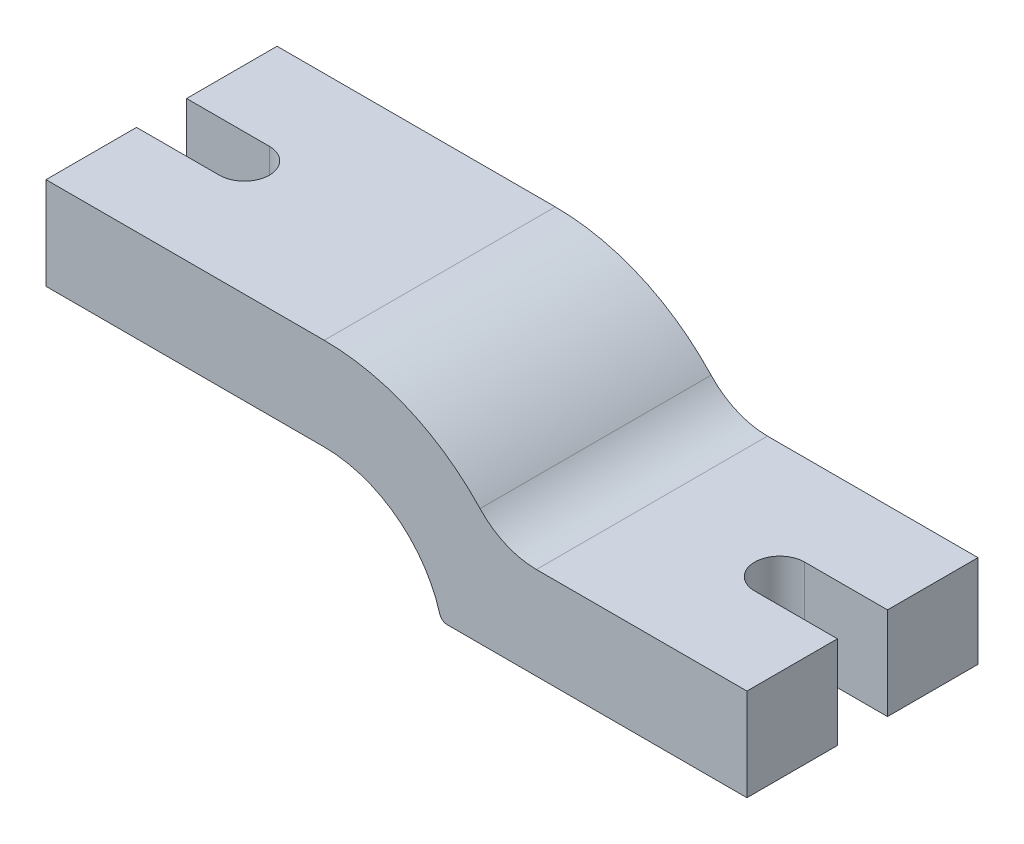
ISO-10303-21;
HEADER;
FILE_DESCRIPTION(('STEP AP214'),'2;1');
FILE_NAME('part.step','',(''),(''),'','','');
FILE_SCHEMA(('AUTOMOTIVE_DESIGN { 1 0 10303 214 1 1 1 1 }'));
ENDSEC;
DATA;
#1=APPLICATION_CONTEXT('core data for automotive mechanical design processes');
#2=APPLICATION_PROTOCOL_DEFINITION('international standard','automotive_design',2000,#1);
#3=PRODUCT_CONTEXT('',#1,'mechanical');
#4=PRODUCT('Part','Part','',(#3));
#5=PRODUCT_RELATED_PRODUCT_CATEGORY('part','',(#4));
#6=PRODUCT_DEFINITION_FORMATION('','',#4);
#7=PRODUCT_DEFINITION_CONTEXT('part definition',#1,'design');
#8=PRODUCT_DEFINITION('design','',#6,#7);
#9=PRODUCT_DEFINITION_SHAPE('','',#8);
#10=(LENGTH_UNIT() NAMED_UNIT(*) SI_UNIT(.MILLI.,.METRE.));
#11=(NAMED_UNIT(*) PLANE_ANGLE_UNIT() SI_UNIT($,.RADIAN.));
#12=(NAMED_UNIT(*) SI_UNIT($,.STERADIAN.) SOLID_ANGLE_UNIT());
#13=UNCERTAINTY_MEASURE_WITH_UNIT(LENGTH_MEASURE(1.E-05),#10,'distance_accuracy_value','');
#14=(GEOMETRIC_REPRESENTATION_CONTEXT(3) GLOBAL_UNCERTAINTY_ASSIGNED_CONTEXT((#13)) GLOBAL_UNIT_ASSIGNED_CONTEXT((#10,
#11,#12)) REPRESENTATION_CONTEXT('',''));
#15=CARTESIAN_POINT('',(0.,0.,0.));
#16=DIRECTION('',(0.,0.,1.));
#17=DIRECTION('',(1.,0.,0.));
#18=AXIS2_PLACEMENT_3D('',#15,#16,#17);
#19=CARTESIAN_POINT('',(54.8786841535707,15.625,30.));
#20=DIRECTION('',(-1.,0.,0.));
#21=DIRECTION('',(0.,0.,1.));
#22=AXIS2_PLACEMENT_3D('',#19,#20,#21);
#23=PLANE('',#22);
#24=DIRECTION('',(0.,0.,-1.));
#25=VECTOR('',#24,1.);
#26=CARTESIAN_POINT('',(54.8786841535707,3.625,30.));
#27=LINE('',#26,#25);
#28=CARTESIAN_POINT('',(54.8786841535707,3.625,30.));
#29=VERTEX_POINT('',#28);
#30=CARTESIAN_POINT('',(54.8786841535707,3.62499999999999,18.25));
#31=VERTEX_POINT('',#30);
#32=EDGE_CURVE('E187',#29,#31,#27,.T.);
#33=ORIENTED_EDGE('',*,*,#32,.T.);
#34=DIRECTION('',(0.,1.,0.));
#35=VECTOR('',#34,1.);
#36=CARTESIAN_POINT('',(54.8786841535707,3.62499999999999,18.25));
#37=LINE('',#36,#35);
#38=CARTESIAN_POINT('',(54.8786841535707,15.625,18.25));
#39=VERTEX_POINT('',#38);
#40=EDGE_CURVE('E234',#31,#39,#37,.T.);
#41=ORIENTED_EDGE('',*,*,#40,.T.);
#42=DIRECTION('',(0.,0.,-1.));
#43=VECTOR('',#42,1.);
#44=CARTESIAN_POINT('',(54.8786841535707,15.625,30.));
#45=LINE('',#44,#43);
#46=CARTESIAN_POINT('',(54.8786841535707,15.625,30.));
#47=VERTEX_POINT('',#46);
#48=EDGE_CURVE('E188',#47,#39,#45,.T.);
#49=ORIENTED_EDGE('',*,*,#48,.F.);
#50=DIRECTION('',(0.,1.,0.));
#51=VECTOR('',#50,1.);
#52=CARTESIAN_POINT('',(54.8786841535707,15.625,30.));
#53=LINE('',#52,#51);
#54=EDGE_CURVE('E262',#29,#47,#53,.T.);
#55=ORIENTED_EDGE('',*,*,#54,.F.);
#56=EDGE_LOOP('',(#33,#41,#49,#55));
#57=FACE_BOUND('',#56,.T.);
#58=ADVANCED_FACE('F39',(#57),#23,.F.);
#59=CARTESIAN_POINT('',(-36.12,15.625,30.));
#60=DIRECTION('',(1.,0.,0.));
#61=DIRECTION('',(0.,0.,-1.));
#62=AXIS2_PLACEMENT_3D('',#59,#60,#61);
#63=PLANE('',#62);
#64=DIRECTION('',(0.,0.,-1.));
#65=VECTOR('',#64,1.);
#66=CARTESIAN_POINT('',(-36.12,15.625,30.));
#67=LINE('',#66,#65);
#68=CARTESIAN_POINT('',(-36.12,15.625,11.75));
#69=VERTEX_POINT('',#68);
#70=CARTESIAN_POINT('',(-36.12,15.625,0.));
#71=VERTEX_POINT('',#70);
#72=EDGE_CURVE('E295',#69,#71,#67,.T.);
#73=ORIENTED_EDGE('',*,*,#72,.F.);
#74=DIRECTION('',(0.,1.,0.));
#75=VECTOR('',#74,1.);
#76=CARTESIAN_POINT('',(-36.12,3.62499999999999,11.75));
#77=LINE('',#76,#75);
#78=CARTESIAN_POINT('',(-36.12,27.625,11.75));
#79=VERTEX_POINT('',#78);
#80=EDGE_CURVE('E248',#69,#79,#77,.T.);
#81=ORIENTED_EDGE('',*,*,#80,.T.);
#82=DIRECTION('',(0.,0.,-1.));
#83=VECTOR('',#82,1.);
#84=CARTESIAN_POINT('',(-36.12,27.625,30.));
#85=LINE('',#84,#83);
#86=CARTESIAN_POINT('',(-36.12,27.625,0.));
#87=VERTEX_POINT('',#86);
#88=EDGE_CURVE('E299',#79,#87,#85,.T.);
#89=ORIENTED_EDGE('',*,*,#88,.T.);
#90=DIRECTION('',(0.,-1.,0.));
#91=VECTOR('',#90,1.);
#92=CARTESIAN_POINT('',(-36.12,15.625,0.));
#93=LINE('',#92,#91);
#94=EDGE_CURVE('E289',#87,#71,#93,.T.);
#95=ORIENTED_EDGE('',*,*,#94,.T.);
#96=EDGE_LOOP('',(#73,#81,#89,#95));
#97=FACE_BOUND('',#96,.T.);
#98=ADVANCED_FACE('F346',(#97),#63,.F.);
#99=CARTESIAN_POINT('',(0.,0.,30.));
#100=DIRECTION('',(0.,0.,-1.));
#101=DIRECTION('',(-1.,0.,0.));
#102=AXIS2_PLACEMENT_3D('',#99,#100,#101);
#103=CYLINDRICAL_SURFACE('',#102,15.625);
#104=CARTESIAN_POINT('',(0.,0.,0.));
#105=DIRECTION('',(0.,0.,-1.));
#106=DIRECTION('',(1.,0.,0.));
#107=AXIS2_PLACEMENT_3D('',#104,#105,#106);
#108=CIRCLE('',#107,15.625);
#109=CARTESIAN_POINT('',(0.,15.625,0.));
#110=VERTEX_POINT('',#109);
#111=CARTESIAN_POINT('',(15.0081949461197,4.34680451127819,0.));
#112=VERTEX_POINT('',#111);
#113=EDGE_CURVE('E251',#110,#112,#108,.T.);
#114=ORIENTED_EDGE('',*,*,#113,.T.);
#115=DIRECTION('',(0.,0.,-1.));
#116=VECTOR('',#115,1.);
#117=CARTESIAN_POINT('',(15.0081949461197,4.34680451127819,30.));
#118=LINE('',#117,#116);
#119=CARTESIAN_POINT('',(15.0081949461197,4.34680451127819,30.));
#120=VERTEX_POINT('',#119);
#121=EDGE_CURVE('E208',#112,#120,#118,.F.);
#122=ORIENTED_EDGE('',*,*,#121,.T.);
#123=CARTESIAN_POINT('',(0.,0.,30.));
#124=DIRECTION('',(0.,0.,-1.));
#125=DIRECTION('',(1.,0.,0.));
#126=AXIS2_PLACEMENT_3D('',#123,#124,#125);
#127=CIRCLE('',#126,15.625);
#128=CARTESIAN_POINT('',(0.,15.625,30.));
#129=VERTEX_POINT('',#128);
#130=EDGE_CURVE('E256',#129,#120,#127,.T.);
#131=ORIENTED_EDGE('',*,*,#130,.F.);
#132=DIRECTION('',(0.,0.,-1.));
#133=VECTOR('',#132,1.);
#134=CARTESIAN_POINT('',(0.,15.625,30.));
#135=LINE('',#134,#133);
#136=EDGE_CURVE('E275',#129,#110,#135,.T.);
#137=ORIENTED_EDGE('',*,*,#136,.T.);
#138=EDGE_LOOP('',(#114,#122,#131,#137));
#139=FACE_BOUND('',#138,.T.);
#140=ADVANCED_FACE('F337',(#139),#103,.F.);
#141=CARTESIAN_POINT('',(54.8786841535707,3.625,30.));
#142=DIRECTION('',(0.,1.,0.));
#143=DIRECTION('',(-1.,0.,0.));
#144=AXIS2_PLACEMENT_3D('',#141,#142,#143);
#145=PLANE('',#144);
#146=CARTESIAN_POINT('',(44.1286841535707,3.62499999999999,15.));
#147=DIRECTION('',(0.,1.,0.));
#148=DIRECTION('',(0.,0.,1.));
#149=AXIS2_PLACEMENT_3D('',#146,#147,#148);
#150=CIRCLE('',#149,3.25);
#151=CARTESIAN_POINT('',(44.1286841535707,3.62499999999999,11.75));
#152=VERTEX_POINT('',#151);
#153=CARTESIAN_POINT('',(44.1286841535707,3.62499999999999,18.25));
#154=VERTEX_POINT('',#153);
#155=EDGE_CURVE('E171',#152,#154,#150,.T.);
#156=ORIENTED_EDGE('',*,*,#155,.T.);
#157=DIRECTION('',(1.,0.,0.));
#158=VECTOR('',#157,1.);
#159=CARTESIAN_POINT('',(54.8786841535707,3.62499999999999,18.25));
#160=LINE('',#159,#158);
#161=EDGE_CURVE('E180',#154,#31,#160,.T.);
#162=ORIENTED_EDGE('',*,*,#161,.T.);
#163=ORIENTED_EDGE('',*,*,#32,.F.);
#164=DIRECTION('',(1.,0.,0.));
#165=VECTOR('',#164,1.);
#166=CARTESIAN_POINT('',(54.8786841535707,3.625,30.));
#167=LINE('',#166,#165);
#168=CARTESIAN_POINT('',(15.9687194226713,3.62499999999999,30.));
#169=VERTEX_POINT('',#168);
#170=EDGE_CURVE('E259',#169,#29,#167,.T.);
#171=ORIENTED_EDGE('',*,*,#170,.F.);
#172=DIRECTION('',(0.,0.,-1.));
#173=VECTOR('',#172,1.);
#174=CARTESIAN_POINT('',(15.9687194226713,3.62499999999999,30.));
#175=LINE('',#174,#173);
#176=CARTESIAN_POINT('',(15.9687194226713,3.62499999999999,0.));
#177=VERTEX_POINT('',#176);
#178=EDGE_CURVE('E204',#169,#177,#175,.T.);
#179=ORIENTED_EDGE('',*,*,#178,.T.);
#180=DIRECTION('',(1.,0.,0.));
#181=VECTOR('',#180,1.);
#182=CARTESIAN_POINT('',(54.8786841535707,3.625,0.));
#183=LINE('',#182,#181);
#184=CARTESIAN_POINT('',(54.8786841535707,3.625,0.));
#185=VERTEX_POINT('',#184);
#186=EDGE_CURVE('E185',#177,#185,#183,.T.);
#187=ORIENTED_EDGE('',*,*,#186,.T.);
#188=CARTESIAN_POINT('',(54.8786841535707,3.62499999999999,11.75));
#189=VERTEX_POINT('',#188);
#190=EDGE_CURVE('E177',#189,#185,#27,.T.);
#191=ORIENTED_EDGE('',*,*,#190,.F.);
#192=DIRECTION('',(-1.,0.,0.));
#193=VECTOR('',#192,1.);
#194=CARTESIAN_POINT('',(54.8786841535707,3.62499999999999,11.75));
#195=LINE('',#194,#193);
#196=EDGE_CURVE('E163',#189,#152,#195,.T.);
#197=ORIENTED_EDGE('',*,*,#196,.T.);
#198=EDGE_LOOP('',(#156,#162,#163,#171,#179,#187,#191,#197));
#199=FACE_BOUND('',#198,.T.);
#200=ADVANCED_FACE('F182',(#199),#145,.F.);
#201=CARTESIAN_POINT('',(54.8786841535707,15.625,11.75));
#202=VERTEX_POINT('',#201);
#203=CARTESIAN_POINT('',(54.8786841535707,15.625,0.));
#204=VERTEX_POINT('',#203);
#205=EDGE_CURVE('E179',#202,#204,#45,.T.);
#206=ORIENTED_EDGE('',*,*,#205,.F.);
#207=DIRECTION('',(0.,1.,0.));
#208=VECTOR('',#207,1.);
#209=CARTESIAN_POINT('',(54.8786841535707,3.62499999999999,11.75));
#210=LINE('',#209,#208);
#211=EDGE_CURVE('E54',#189,#202,#210,.T.);
#212=ORIENTED_EDGE('',*,*,#211,.F.);
#213=ORIENTED_EDGE('',*,*,#190,.T.);
#214=DIRECTION('',(0.,1.,0.));
#215=VECTOR('',#214,1.);
#216=CARTESIAN_POINT('',(54.8786841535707,15.625,0.));
#217=LINE('',#216,#215);
#218=EDGE_CURVE('E279',#185,#204,#217,.T.);
#219=ORIENTED_EDGE('',*,*,#218,.T.);
#220=EDGE_LOOP('',(#206,#212,#213,#219));
#221=FACE_BOUND('',#220,.T.);
#222=ADVANCED_FACE('F175',(#221),#23,.F.);
#223=CARTESIAN_POINT('',(22.781571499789,15.625,30.));
#224=DIRECTION('',(0.,-1.,0.));
#225=DIRECTION('',(1.,0.,0.));
#226=AXIS2_PLACEMENT_3D('',#223,#224,#225);
#227=PLANE('',#226);
#228=ORIENTED_EDGE('',*,*,#48,.T.);
#229=DIRECTION('',(-1.,0.,0.));
#230=VECTOR('',#229,1.);
#231=CARTESIAN_POINT('',(22.781571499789,15.625,18.25));
#232=LINE('',#231,#230);
#233=CARTESIAN_POINT('',(44.1286841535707,15.625,18.25));
#234=VERTEX_POINT('',#233);
#235=EDGE_CURVE('E11',#39,#234,#232,.T.);
#236=ORIENTED_EDGE('',*,*,#235,.T.);
#237=CARTESIAN_POINT('',(44.1286841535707,15.625,15.));
#238=DIRECTION('',(0.,-1.,0.));
#239=DIRECTION('',(1.,0.,0.));
#240=AXIS2_PLACEMENT_3D('',#237,#238,#239);
#241=CIRCLE('',#240,3.25);
#242=CARTESIAN_POINT('',(44.1286841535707,15.625,11.75));
#243=VERTEX_POINT('',#242);
#244=EDGE_CURVE('E47',#234,#243,#241,.T.);
#245=ORIENTED_EDGE('',*,*,#244,.T.);
#246=DIRECTION('',(1.,0.,0.));
#247=VECTOR('',#246,1.);
#248=CARTESIAN_POINT('',(22.781571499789,15.625,11.75));
#249=LINE('',#248,#247);
#250=EDGE_CURVE('E221',#243,#202,#249,.T.);
#251=ORIENTED_EDGE('',*,*,#250,.T.);
#252=ORIENTED_EDGE('',*,*,#205,.T.);
#253=DIRECTION('',(-1.,0.,0.));
#254=VECTOR('',#253,1.);
#255=CARTESIAN_POINT('',(22.781571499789,15.625,0.));
#256=LINE('',#255,#254);
#257=CARTESIAN_POINT('',(27.5499546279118,15.625,0.));
#258=VERTEX_POINT('',#257);
#259=EDGE_CURVE('E281',#204,#258,#256,.T.);
#260=ORIENTED_EDGE('',*,*,#259,.T.);
#261=DIRECTION('',(0.,0.,1.));
#262=VECTOR('',#261,1.);
#263=CARTESIAN_POINT('',(27.5499546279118,15.625,30.));
#264=LINE('',#263,#262);
#265=CARTESIAN_POINT('',(27.5499546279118,15.625,30.));
#266=VERTEX_POINT('',#265);
#267=EDGE_CURVE('E198',#258,#266,#264,.T.);
#268=ORIENTED_EDGE('',*,*,#267,.T.);
#269=DIRECTION('',(-1.,0.,0.));
#270=VECTOR('',#269,1.);
#271=CARTESIAN_POINT('',(22.781571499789,15.625,30.));
#272=LINE('',#271,#270);
#273=EDGE_CURVE('E264',#47,#266,#272,.T.);
#274=ORIENTED_EDGE('',*,*,#273,.F.);
#275=EDGE_LOOP('',(#228,#236,#245,#251,#252,#260,#268,#274));
#276=FACE_BOUND('',#275,.T.);
#277=ADVANCED_FACE('F224',(#276),#227,.F.);
#278=CARTESIAN_POINT('',(0.,0.,30.));
#279=DIRECTION('',(0.,0.,-1.));
#280=DIRECTION('',(-1.,0.,0.));
#281=AXIS2_PLACEMENT_3D('',#278,#279,#280);
#282=CYLINDRICAL_SURFACE('',#281,27.625);
#283=CARTESIAN_POINT('',(0.,0.,30.));
#284=DIRECTION('',(0.,0.,1.));
#285=DIRECTION('',(1.,0.,0.));
#286=AXIS2_PLACEMENT_3D('',#283,#284,#285);
#287=CIRCLE('',#286,27.625);
#288=CARTESIAN_POINT('',(20.2277075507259,18.8143687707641,30.));
#289=VERTEX_POINT('',#288);
#290=CARTESIAN_POINT('',(0.,27.625,30.));
#291=VERTEX_POINT('',#290);
#292=EDGE_CURVE('E267',#289,#291,#287,.T.);
#293=ORIENTED_EDGE('',*,*,#292,.F.);
#294=DIRECTION('',(0.,0.,-1.));
#295=VECTOR('',#294,1.);
#296=CARTESIAN_POINT('',(20.227707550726,18.8143687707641,30.));
#297=LINE('',#296,#295);
#298=CARTESIAN_POINT('',(20.2277075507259,18.8143687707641,0.));
#299=VERTEX_POINT('',#298);
#300=EDGE_CURVE('E191',#289,#299,#297,.T.);
#301=ORIENTED_EDGE('',*,*,#300,.T.);
#302=CARTESIAN_POINT('',(0.,0.,0.));
#303=DIRECTION('',(0.,0.,1.));
#304=DIRECTION('',(1.,0.,0.));
#305=AXIS2_PLACEMENT_3D('',#302,#303,#304);
#306=CIRCLE('',#305,27.625);
#307=CARTESIAN_POINT('',(0.,27.625,0.));
#308=VERTEX_POINT('',#307);
#309=EDGE_CURVE('E284',#299,#308,#306,.T.);
#310=ORIENTED_EDGE('',*,*,#309,.T.);
#311=DIRECTION('',(0.,0.,-1.));
#312=VECTOR('',#311,1.);
#313=CARTESIAN_POINT('',(0.,27.625,30.));
#314=LINE('',#313,#312);
#315=EDGE_CURVE('E302',#291,#308,#314,.T.);
#316=ORIENTED_EDGE('',*,*,#315,.F.);
#317=EDGE_LOOP('',(#293,#301,#310,#316));
#318=FACE_BOUND('',#317,.T.);
#319=ADVANCED_FACE('F319',(#318),#282,.T.);
#320=CARTESIAN_POINT('',(-36.12,27.625,30.));
#321=DIRECTION('',(0.,-1.,0.));
#322=DIRECTION('',(0.,0.,-1.));
#323=AXIS2_PLACEMENT_3D('',#320,#321,#322);
#324=PLANE('',#323);
#325=ORIENTED_EDGE('',*,*,#88,.F.);
#326=DIRECTION('',(-1.,0.,0.));
#327=VECTOR('',#326,1.);
#328=CARTESIAN_POINT('',(-36.12,27.625,11.75));
#329=LINE('',#328,#327);
#330=CARTESIAN_POINT('',(-25.37,27.625,11.75));
#331=VERTEX_POINT('',#330);
#332=EDGE_CURVE('E245',#331,#79,#329,.T.);
#333=ORIENTED_EDGE('',*,*,#332,.F.);
#334=CARTESIAN_POINT('',(-25.37,27.625,15.));
#335=DIRECTION('',(0.,1.,0.));
#336=DIRECTION('',(0.,0.,1.));
#337=AXIS2_PLACEMENT_3D('',#334,#335,#336);
#338=CIRCLE('',#337,3.25);
#339=CARTESIAN_POINT('',(-25.37,27.625,18.25));
#340=VERTEX_POINT('',#339);
#341=EDGE_CURVE('E242',#340,#331,#338,.T.);
#342=ORIENTED_EDGE('',*,*,#341,.F.);
#343=DIRECTION('',(1.,0.,0.));
#344=VECTOR('',#343,1.);
#345=CARTESIAN_POINT('',(-36.12,27.625,18.25));
#346=LINE('',#345,#344);
#347=CARTESIAN_POINT('',(-36.12,27.625,18.25));
#348=VERTEX_POINT('',#347);
#349=EDGE_CURVE('E236',#348,#340,#346,.T.);
#350=ORIENTED_EDGE('',*,*,#349,.F.);
#351=CARTESIAN_POINT('',(-36.12,27.625,30.));
#352=VERTEX_POINT('',#351);
#353=EDGE_CURVE('E300',#352,#348,#85,.T.);
#354=ORIENTED_EDGE('',*,*,#353,.F.);
#355=DIRECTION('',(-1.,0.,0.));
#356=VECTOR('',#355,1.);
#357=CARTESIAN_POINT('',(-36.12,27.625,30.));
#358=LINE('',#357,#356);
#359=EDGE_CURVE('E269',#291,#352,#358,.T.);
#360=ORIENTED_EDGE('',*,*,#359,.F.);
#361=ORIENTED_EDGE('',*,*,#315,.T.);
#362=DIRECTION('',(-1.,0.,0.));
#363=VECTOR('',#362,1.);
#364=CARTESIAN_POINT('',(-36.12,27.625,0.));
#365=LINE('',#364,#363);
#366=EDGE_CURVE('E286',#308,#87,#365,.T.);
#367=ORIENTED_EDGE('',*,*,#366,.T.);
#368=EDGE_LOOP('',(#325,#333,#342,#350,#354,#360,#361,#367));
#369=FACE_BOUND('',#368,.T.);
#370=ADVANCED_FACE('F349',(#369),#324,.F.);
#371=ORIENTED_EDGE('',*,*,#353,.T.);
#372=DIRECTION('',(0.,1.,0.));
#373=VECTOR('',#372,1.);
#374=CARTESIAN_POINT('',(-36.12,3.62499999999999,18.25));
#375=LINE('',#374,#373);
#376=CARTESIAN_POINT('',(-36.12,15.625,18.25));
#377=VERTEX_POINT('',#376);
#378=EDGE_CURVE('E247',#377,#348,#375,.T.);
#379=ORIENTED_EDGE('',*,*,#378,.F.);
#380=CARTESIAN_POINT('',(-36.12,15.625,30.));
#381=VERTEX_POINT('',#380);
#382=EDGE_CURVE('E296',#381,#377,#67,.T.);
#383=ORIENTED_EDGE('',*,*,#382,.F.);
#384=DIRECTION('',(0.,-1.,0.));
#385=VECTOR('',#384,1.);
#386=CARTESIAN_POINT('',(-36.12,15.625,30.));
#387=LINE('',#386,#385);
#388=EDGE_CURVE('E271',#352,#381,#387,.T.);
#389=ORIENTED_EDGE('',*,*,#388,.F.);
#390=EDGE_LOOP('',(#371,#379,#383,#389));
#391=FACE_BOUND('',#390,.T.);
#392=ADVANCED_FACE('F351',(#391),#63,.F.);
#393=CARTESIAN_POINT('',(0.,15.625,30.));
#394=DIRECTION('',(0.,1.,0.));
#395=DIRECTION('',(-1.,0.,0.));
#396=AXIS2_PLACEMENT_3D('',#393,#394,#395);
#397=PLANE('',#396);
#398=CARTESIAN_POINT('',(-25.37,15.625,15.));
#399=DIRECTION('',(0.,1.,0.));
#400=DIRECTION('',(-1.,0.,0.));
#401=AXIS2_PLACEMENT_3D('',#398,#399,#400);
#402=CIRCLE('',#401,3.25);
#403=CARTESIAN_POINT('',(-25.37,15.625,18.25));
#404=VERTEX_POINT('',#403);
#405=CARTESIAN_POINT('',(-25.37,15.625,11.75));
#406=VERTEX_POINT('',#405);
#407=EDGE_CURVE('E215',#404,#406,#402,.T.);
#408=ORIENTED_EDGE('',*,*,#407,.T.);
#409=DIRECTION('',(-1.,0.,0.));
#410=VECTOR('',#409,1.);
#411=CARTESIAN_POINT('',(0.,15.625,11.75));
#412=LINE('',#411,#410);
#413=EDGE_CURVE('E218',#406,#69,#412,.T.);
#414=ORIENTED_EDGE('',*,*,#413,.T.);
#415=ORIENTED_EDGE('',*,*,#72,.T.);
#416=DIRECTION('',(1.,0.,0.));
#417=VECTOR('',#416,1.);
#418=CARTESIAN_POINT('',(0.,15.625,0.));
#419=LINE('',#418,#417);
#420=EDGE_CURVE('E260',#71,#110,#419,.T.);
#421=ORIENTED_EDGE('',*,*,#420,.T.);
#422=ORIENTED_EDGE('',*,*,#136,.F.);
#423=DIRECTION('',(1.,0.,0.));
#424=VECTOR('',#423,1.);
#425=CARTESIAN_POINT('',(0.,15.625,30.));
#426=LINE('',#425,#424);
#427=EDGE_CURVE('E273',#381,#129,#426,.T.);
#428=ORIENTED_EDGE('',*,*,#427,.F.);
#429=ORIENTED_EDGE('',*,*,#382,.T.);
#430=DIRECTION('',(1.,0.,0.));
#431=VECTOR('',#430,1.);
#432=CARTESIAN_POINT('',(0.,15.625,18.25));
#433=LINE('',#432,#431);
#434=EDGE_CURVE('E212',#377,#404,#433,.T.);
#435=ORIENTED_EDGE('',*,*,#434,.T.);
#436=EDGE_LOOP('',(#408,#414,#415,#421,#422,#428,#429,#435));
#437=FACE_BOUND('',#436,.T.);
#438=ADVANCED_FACE('F342',(#437),#397,.F.);
#439=CARTESIAN_POINT('',(0.,0.,30.));
#440=DIRECTION('',(0.,0.,1.));
#441=DIRECTION('',(1.,0.,0.));
#442=AXIS2_PLACEMENT_3D('',#439,#440,#441);
#443=PLANE('',#442);
#444=ORIENTED_EDGE('',*,*,#130,.T.);
#445=CARTESIAN_POINT('',(15.9687194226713,4.62499999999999,30.));
#446=DIRECTION('',(0.,0.,1.));
#447=DIRECTION('',(1.,0.,0.));
#448=AXIS2_PLACEMENT_3D('',#445,#446,#447);
#449=CIRCLE('',#448,1.);
#450=EDGE_CURVE('E210',#120,#169,#449,.T.);
#451=ORIENTED_EDGE('',*,*,#450,.T.);
#452=ORIENTED_EDGE('',*,*,#170,.T.);
#453=ORIENTED_EDGE('',*,*,#54,.T.);
#454=ORIENTED_EDGE('',*,*,#273,.T.);
#455=CARTESIAN_POINT('',(27.5499546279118,25.625,30.));
#456=DIRECTION('',(0.,0.,1.));
#457=DIRECTION('',(1.,0.,0.));
#458=AXIS2_PLACEMENT_3D('',#455,#456,#457);
#459=CIRCLE('',#458,10.);
#460=EDGE_CURVE('E202',#266,#289,#459,.F.);
#461=ORIENTED_EDGE('',*,*,#460,.T.);
#462=ORIENTED_EDGE('',*,*,#292,.T.);
#463=ORIENTED_EDGE('',*,*,#359,.T.);
#464=ORIENTED_EDGE('',*,*,#388,.T.);
#465=ORIENTED_EDGE('',*,*,#427,.T.);
#466=EDGE_LOOP('',(#444,#451,#452,#453,#454,#461,#462,#463,#464,#465));
#467=FACE_BOUND('',#466,.T.);
#468=ADVANCED_FACE('F321',(#467),#443,.T.);
#469=CARTESIAN_POINT('',(0.,0.,0.));
#470=DIRECTION('',(0.,0.,1.));
#471=DIRECTION('',(1.,0.,0.));
#472=AXIS2_PLACEMENT_3D('',#469,#470,#471);
#473=PLANE('',#472);
#474=ORIENTED_EDGE('',*,*,#186,.F.);
#475=CARTESIAN_POINT('',(15.9687194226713,4.62499999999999,0.));
#476=DIRECTION('',(0.,0.,1.));
#477=DIRECTION('',(1.,0.,0.));
#478=AXIS2_PLACEMENT_3D('',#475,#476,#477);
#479=CIRCLE('',#478,1.);
#480=EDGE_CURVE('E206',#177,#112,#479,.F.);
#481=ORIENTED_EDGE('',*,*,#480,.T.);
#482=ORIENTED_EDGE('',*,*,#113,.F.);
#483=ORIENTED_EDGE('',*,*,#420,.F.);
#484=ORIENTED_EDGE('',*,*,#94,.F.);
#485=ORIENTED_EDGE('',*,*,#366,.F.);
#486=ORIENTED_EDGE('',*,*,#309,.F.);
#487=CARTESIAN_POINT('',(27.5499546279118,25.625,0.));
#488=DIRECTION('',(0.,0.,1.));
#489=DIRECTION('',(1.,0.,0.));
#490=AXIS2_PLACEMENT_3D('',#487,#488,#489);
#491=CIRCLE('',#490,10.);
#492=EDGE_CURVE('E200',#299,#258,#491,.T.);
#493=ORIENTED_EDGE('',*,*,#492,.T.);
#494=ORIENTED_EDGE('',*,*,#259,.F.);
#495=ORIENTED_EDGE('',*,*,#218,.F.);
#496=EDGE_LOOP('',(#474,#481,#482,#483,#484,#485,#486,#493,#494,#495));
#497=FACE_BOUND('',#496,.T.);
#498=ADVANCED_FACE('F311',(#497),#473,.F.);
#499=CARTESIAN_POINT('',(27.5499546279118,25.625,30.));
#500=DIRECTION('',(0.,0.,-1.));
#501=DIRECTION('',(-1.,0.,0.));
#502=AXIS2_PLACEMENT_3D('',#499,#500,#501);
#503=CYLINDRICAL_SURFACE('',#502,10.);
#504=ORIENTED_EDGE('',*,*,#460,.F.);
#505=ORIENTED_EDGE('',*,*,#267,.F.);
#506=ORIENTED_EDGE('',*,*,#492,.F.);
#507=ORIENTED_EDGE('',*,*,#300,.F.);
#508=EDGE_LOOP('',(#504,#505,#506,#507));
#509=FACE_BOUND('',#508,.T.);
#510=ADVANCED_FACE('F316',(#509),#503,.F.);
#511=CARTESIAN_POINT('',(15.9687194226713,4.62499999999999,30.));
#512=DIRECTION('',(0.,0.,-1.));
#513=DIRECTION('',(-1.,0.,0.));
#514=AXIS2_PLACEMENT_3D('',#511,#512,#513);
#515=CYLINDRICAL_SURFACE('',#514,1.);
#516=ORIENTED_EDGE('',*,*,#450,.F.);
#517=ORIENTED_EDGE('',*,*,#121,.F.);
#518=ORIENTED_EDGE('',*,*,#480,.F.);
#519=ORIENTED_EDGE('',*,*,#178,.F.);
#520=EDGE_LOOP('',(#516,#517,#518,#519));
#521=FACE_BOUND('',#520,.T.);
#522=ADVANCED_FACE('F41',(#521),#515,.T.);
#523=CARTESIAN_POINT('',(-36.12,3.62499999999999,11.75));
#524=DIRECTION('',(0.,0.,-1.));
#525=DIRECTION('',(-1.,0.,0.));
#526=AXIS2_PLACEMENT_3D('',#523,#524,#525);
#527=PLANE('',#526);
#528=DIRECTION('',(0.,1.,0.));
#529=VECTOR('',#528,1.);
#530=CARTESIAN_POINT('',(-25.37,3.62499999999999,11.75));
#531=LINE('',#530,#529);
#532=EDGE_CURVE('E252',#406,#331,#531,.T.);
#533=ORIENTED_EDGE('',*,*,#532,.T.);
#534=ORIENTED_EDGE('',*,*,#332,.T.);
#535=ORIENTED_EDGE('',*,*,#80,.F.);
#536=ORIENTED_EDGE('',*,*,#413,.F.);
#537=EDGE_LOOP('',(#533,#534,#535,#536));
#538=FACE_BOUND('',#537,.T.);
#539=ADVANCED_FACE('F381',(#538),#527,.F.);
#540=CARTESIAN_POINT('',(-25.37,3.62499999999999,15.));
#541=DIRECTION('',(0.,1.,0.));
#542=DIRECTION('',(0.,0.,1.));
#543=AXIS2_PLACEMENT_3D('',#540,#541,#542);
#544=CYLINDRICAL_SURFACE('',#543,3.25);
#545=DIRECTION('',(0.,1.,0.));
#546=VECTOR('',#545,1.);
#547=CARTESIAN_POINT('',(-25.37,3.62499999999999,18.25));
#548=LINE('',#547,#546);
#549=EDGE_CURVE('E62',#404,#340,#548,.T.);
#550=ORIENTED_EDGE('',*,*,#549,.T.);
#551=ORIENTED_EDGE('',*,*,#341,.T.);
#552=ORIENTED_EDGE('',*,*,#532,.F.);
#553=ORIENTED_EDGE('',*,*,#407,.F.);
#554=EDGE_LOOP('',(#550,#551,#552,#553));
#555=FACE_BOUND('',#554,.T.);
#556=ADVANCED_FACE('F477',(#555),#544,.F.);
#557=CARTESIAN_POINT('',(-36.12,3.62499999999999,18.25));
#558=DIRECTION('',(0.,0.,1.));
#559=DIRECTION('',(1.,0.,0.));
#560=AXIS2_PLACEMENT_3D('',#557,#558,#559);
#561=PLANE('',#560);
#562=ORIENTED_EDGE('',*,*,#378,.T.);
#563=ORIENTED_EDGE('',*,*,#349,.T.);
#564=ORIENTED_EDGE('',*,*,#549,.F.);
#565=ORIENTED_EDGE('',*,*,#434,.F.);
#566=EDGE_LOOP('',(#562,#563,#564,#565));
#567=FACE_BOUND('',#566,.T.);
#568=ADVANCED_FACE('F489',(#567),#561,.F.);
#569=CARTESIAN_POINT('',(54.8786841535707,3.62499999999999,18.25));
#570=DIRECTION('',(0.,0.,1.));
#571=DIRECTION('',(1.,0.,0.));
#572=AXIS2_PLACEMENT_3D('',#569,#570,#571);
#573=PLANE('',#572);
#574=ORIENTED_EDGE('',*,*,#40,.F.);
#575=ORIENTED_EDGE('',*,*,#161,.F.);
#576=DIRECTION('',(0.,1.,0.));
#577=VECTOR('',#576,1.);
#578=CARTESIAN_POINT('',(44.1286841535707,3.62499999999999,18.25));
#579=LINE('',#578,#577);
#580=EDGE_CURVE('E228',#154,#234,#579,.T.);
#581=ORIENTED_EDGE('',*,*,#580,.T.);
#582=ORIENTED_EDGE('',*,*,#235,.F.);
#583=EDGE_LOOP('',(#574,#575,#581,#582));
#584=FACE_BOUND('',#583,.T.);
#585=ADVANCED_FACE('F231',(#584),#573,.F.);
#586=CARTESIAN_POINT('',(44.1286841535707,3.62499999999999,15.));
#587=DIRECTION('',(0.,1.,0.));
#588=DIRECTION('',(0.,0.,1.));
#589=AXIS2_PLACEMENT_3D('',#586,#587,#588);
#590=CYLINDRICAL_SURFACE('',#589,3.25);
#591=ORIENTED_EDGE('',*,*,#580,.F.);
#592=ORIENTED_EDGE('',*,*,#155,.F.);
#593=DIRECTION('',(0.,1.,0.));
#594=VECTOR('',#593,1.);
#595=CARTESIAN_POINT('',(44.1286841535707,3.62499999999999,11.75));
#596=LINE('',#595,#594);
#597=EDGE_CURVE('E166',#152,#243,#596,.T.);
#598=ORIENTED_EDGE('',*,*,#597,.T.);
#599=ORIENTED_EDGE('',*,*,#244,.F.);
#600=EDGE_LOOP('',(#591,#592,#598,#599));
#601=FACE_BOUND('',#600,.T.);
#602=ADVANCED_FACE('F227',(#601),#590,.F.);
#603=CARTESIAN_POINT('',(54.8786841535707,3.62499999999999,11.75));
#604=DIRECTION('',(0.,0.,-1.));
#605=DIRECTION('',(-1.,0.,0.));
#606=AXIS2_PLACEMENT_3D('',#603,#604,#605);
#607=PLANE('',#606);
#608=ORIENTED_EDGE('',*,*,#597,.F.);
#609=ORIENTED_EDGE('',*,*,#196,.F.);
#610=ORIENTED_EDGE('',*,*,#211,.T.);
#611=ORIENTED_EDGE('',*,*,#250,.F.);
#612=EDGE_LOOP('',(#608,#609,#610,#611));
#613=FACE_BOUND('',#612,.T.);
#614=ADVANCED_FACE('F164',(#613),#607,.F.);
#615=CLOSED_SHELL('',(#58,#98,#140,#200,#222,#277,#319,#370,#392,#438,#468,#498,#510,#522,#539,
#556,#568,#585,#602,#614));
#616=MANIFOLD_SOLID_BREP('B2',#615);
#617=ADVANCED_BREP_SHAPE_REPRESENTATION('',(#18,#616),#14);
#618=SHAPE_DEFINITION_REPRESENTATION(#9,#617);
ENDSEC;
END-ISO-10303-21;
